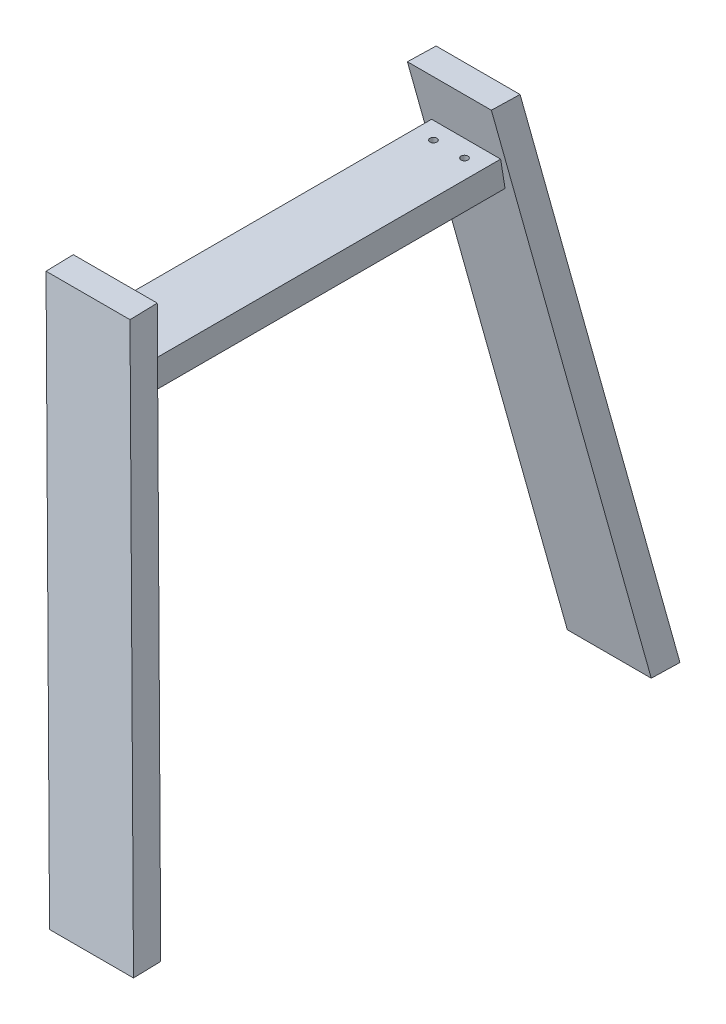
from build123d import *

# Parameters (mm, degrees)
SCHIZZO1_W                    = 100
SCHIZZO1_H                    = 40
SCHIZZO1_W_2                  = 97
SCHIZZO1_H_2                  = 37
ESTRUSIONE_SOTTILE1_DEPTH     = 300
SCHIZZO11_W                   = 100
SCHIZZO11_H                   = 40
ESTRUSIONE_ESTRUSIONE4_DEPTH  = 300
TAGLIO_ESTRUSIONE1_DEPTH      = 307.757233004
TAGLIO_ESTRUSIONE1_DEPTH_BACK = 307.757233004
TAGLIO_ESTRUSIONE6_DEPTH      = 291.753652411
TAGLIO_ESTRUSIONE6_DEPTH_BACK = 291.753652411
ESTRUSIONE_ESTRUSIONE2_DEPTH  = 903.979154
TAGLIO_ESTRUSIONE2_DEPTH      = 841.500522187
TAGLIO_ESTRUSIONE2_DEPTH_BACK = 841.500522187
TAGLIO_ESTRUSIONE3_DEPTH      = 841.500522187
TAGLIO_ESTRUSIONE3_DEPTH_BACK = 841.500522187
SCHIZZO8_R                    = 5
TAGLIO_ESTRUSIONE4_DEPTH      = 70
SCHIZZO9_R                    = 9
TAGLIO_ESTRUSIONE5_DEPTH      = 10


with BuildPart() as part:
    # Schizzo1 → Estrusione-Sottile1 (new body)
    with BuildSketch(Plane.XY):
        with Locations((0, -20)):
            Rectangle(SCHIZZO1_W, SCHIZZO1_H)
        with Locations((0, -20)):
            Rectangle(SCHIZZO1_W_2, SCHIZZO1_H_2, mode=Mode.SUBTRACT)
    extrude(amount=ESTRUSIONE_SOTTILE1_DEPTH)

    # Schizzo11 → Estrusione-Estrusione4 (add)
    with BuildSketch(Plane.XY):
        with Locations((0, -20)):
            Rectangle(SCHIZZO11_W, SCHIZZO11_H)
    extrude(amount=ESTRUSIONE_ESTRUSIONE4_DEPTH)

    # Schizzo2 → Taglio-Estrusione1 (cut, two sides: drawn at the far end of the back side and taken through both)
    with BuildSketch(Plane(origin=(0, 0, 0), x_dir=(0, 0, -1), z_dir=(1, 0, 0)).offset(-TAGLIO_ESTRUSIONE1_DEPTH_BACK)):
        Polygon((-218.617060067, 1509.126735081), (-279, 70), (-281.937062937, 0), (-309, -645), (-369.382939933, -2084.126735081), (-3247.636410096, -1963.360855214), (-3096.870530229, 1629.892614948), align=None)
    extrude(amount=TAGLIO_ESTRUSIONE1_DEPTH + TAGLIO_ESTRUSIONE1_DEPTH_BACK, mode=Mode.SUBTRACT)

    # Schizzo12 → Taglio-Estrusione6 (cut, two sides: drawn at the far end of the back side and taken through both)
    with BuildSketch(Plane(origin=(0, 0, 0), x_dir=(0, 0, -1), z_dir=(1, 0, 0)).offset(-TAGLIO_ESTRUSIONE6_DEPTH_BACK)):
        Polygon((9.744647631, 1769.966447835), (-244.1398922, 178.451422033), (-264.119149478, 53.208316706), (-275, -15), (-375.5, -645), (-384.655064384, -702.389955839), (-638.539604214, -2293.904981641), (-3821.569655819, -1786.13590198), (-3173.285403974, 2277.735527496), align=None)
    extrude(amount=TAGLIO_ESTRUSIONE6_DEPTH + TAGLIO_ESTRUSIONE6_DEPTH_BACK, mode=Mode.SUBTRACT)

    # Schizzo5 → Estrusione-Estrusione2 (add)
    with BuildSketch(Plane(origin=(-32.241903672, 178.451422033, 244.1398922), x_dir=(0.9865400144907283, 0.163392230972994, -0.00646364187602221), z_dir=(-0.16240075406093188, 0.9744045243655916, -0.15544072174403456))):
        Polygon((-60.37588995, 18.834858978), (59.601627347, 21.157646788), (60.37588995, -18.834858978), (-59.601627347, -21.157646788), align=None)
    extrude(amount=-ESTRUSIONE_ESTRUSIONE2_DEPTH)

    # Schizzo6 → Taglio-Estrusione2 (cut, two sides: drawn at the far end of the back side and taken through both)
    with BuildSketch(Plane.XY.offset(-TAGLIO_ESTRUSIONE2_DEPTH_BACK)):
        Polygon((-1785.065933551, 65), (-112.804446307, 65), (91.607421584, 65), (1763.868908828, 65), (1763.868908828, 3409.522974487), (-1785.065933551, 3409.522974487), align=None)
    extrude(amount=TAGLIO_ESTRUSIONE2_DEPTH + TAGLIO_ESTRUSIONE2_DEPTH_BACK, mode=Mode.SUBTRACT)

    # Schizzo7 → Taglio-Estrusione3 (cut, two sides: drawn at the far end of the back side and taken through both)
    with BuildSketch(Plane.XY.offset(-TAGLIO_ESTRUSIONE3_DEPTH_BACK)):
        Polygon((-2255.576250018, -645), (-408.776341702, -645), (263.243909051, -645), (2110.043817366, -645), (2110.043817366, -4338.599816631), (-2255.576250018, -4338.599816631), align=None)
    extrude(amount=TAGLIO_ESTRUSIONE3_DEPTH + TAGLIO_ESTRUSIONE3_DEPTH_BACK, mode=Mode.SUBTRACT)

    # Schizzo8 → Taglio-Estrusione4 (cut)
    with BuildSketch(Plane(origin=(0, 0, 0), x_dir=(1, 0, 0), z_dir=(0, 1, 0))):
        with Locations(Location((-22.5, -227.5, 0), (0, 0, 270))):
            Circle(SCHIZZO8_R)
        with Locations(Location((22.5, -227.5, 0), (0, 0, 270))):
            Circle(SCHIZZO8_R)
    extrude(amount=-TAGLIO_ESTRUSIONE4_DEPTH, mode=Mode.SUBTRACT)

    # Schizzo9 → Taglio-Estrusione5 (cut)
    with BuildSketch(Plane.XZ.offset(40)):
        with Locations((22.5, 227.5)):
            Circle(SCHIZZO9_R)
        with Locations((-22.5, 227.5)):
            Circle(SCHIZZO9_R)
    extrude(amount=-TAGLIO_ESTRUSIONE5_DEPTH, mode=Mode.SUBTRACT)

    # Specchia1: part across plane


with BuildPart() as part_1:
    add(part.part)
    add(part.part.mirror(Plane.XY))


solid = part_1.part
